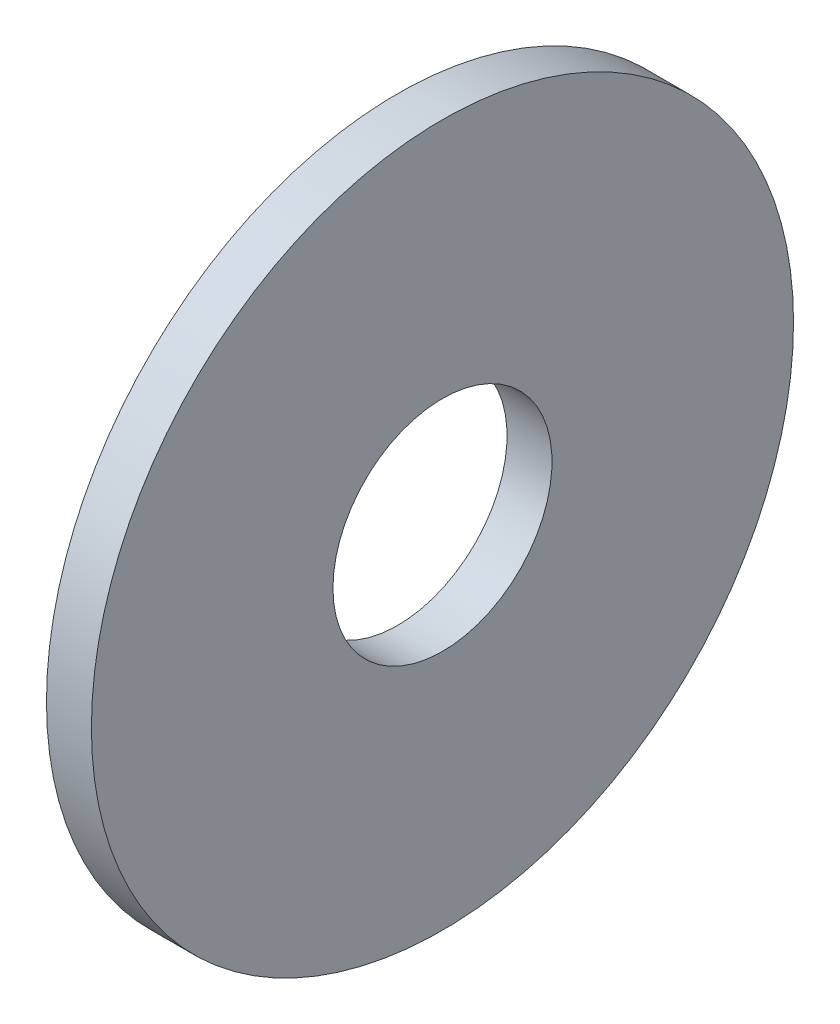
from build123d import *

# Parameters (mm, degrees)
SKETCH1_W = 8
SKETCH1_H = 43


with BuildPart() as part:
    # Sketch1 → Base-Revolve (revolve)
    with BuildSketch(Plane.XY, mode=Mode.PRIVATE) as base_revolve_sk:
        with Locations((-4, 41)):
            Rectangle(SKETCH1_W, SKETCH1_H)
    revolve(base_revolve_sk.sketch.rotate(Axis((-34.925, 0, 0), (1, 0, 0)), 90), axis=Axis((-34.925, 0, 0), (1, 0, 0)))


solid = part.part
